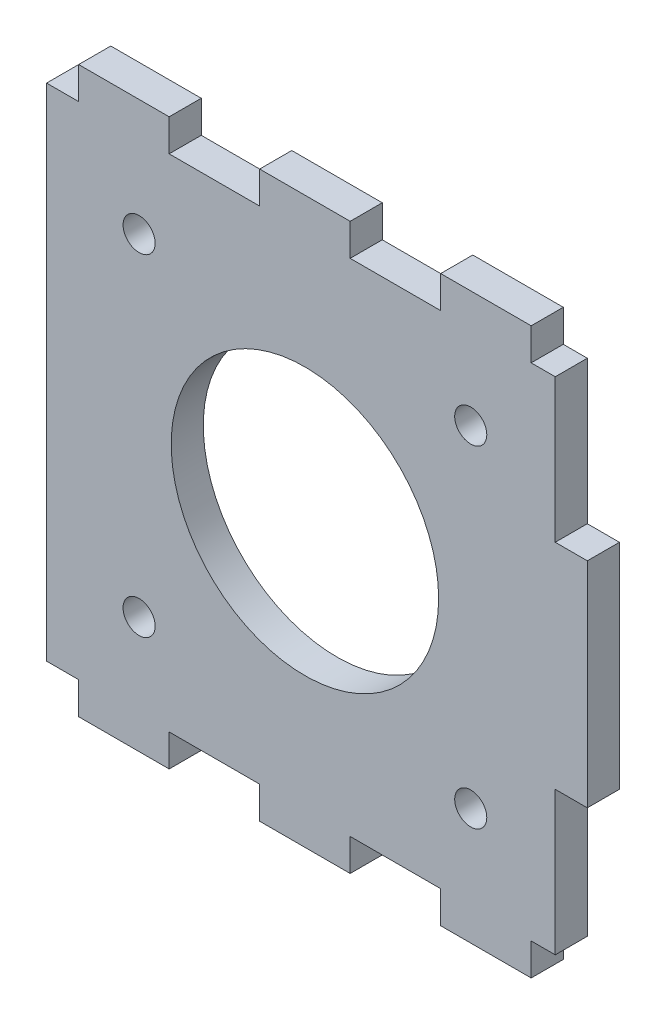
from build123d import *

# Parameters (mm, degrees)
SKETCH1_R           = 1.5
SKETCH1_R_2         = 12.5
SKETCH1_W           = 8.46
SKETCH1_H           = 3
SKETCH1_W_2         = 3
SKETCH1_H_2         = 20
BOSS_EXTRUDE1_DEPTH = 3


with BuildPart() as part:
    # Sketch1 → Boss-Extrude1 (new body)
    # profile 1 of 8: a face of its own
    with BuildSketch(Plane.XY):
        Polygon((3.105, -23.4), (11.565, -23.4), (20.025, -23.4), (22.275, -23.4), (22.275, -10), (22.275, 10), (22.275, 23.4), (20.025, 23.4), (11.565, 23.4), (3.105, 23.4), (-5.355, 23.4), (-13.815, 23.4), (-22.275, 23.4), (-25.275, 23.4), (-25.275, -23.4), (-22.275, -23.4), (-13.815, -23.4), (-5.355, -23.4), align=None)
        with Locations((-16.625, -15.5)):
            Circle(SKETCH1_R, mode=Mode.SUBTRACT)
        with Locations((-1.125, 0)):
            Circle(SKETCH1_R_2, mode=Mode.SUBTRACT)
        with Locations((14.375, -15.5)):
            Circle(SKETCH1_R, mode=Mode.SUBTRACT)
        with Locations((-16.625, 15.5)):
            Circle(SKETCH1_R, mode=Mode.SUBTRACT)
        with Locations((14.375, 15.5)):
            Circle(SKETCH1_R, mode=Mode.SUBTRACT)
    # profile 2 of 8: a face of its own
    with BuildSketch(Plane.XY):
        with Locations((15.795, 24.9)):
            Rectangle(SKETCH1_W, SKETCH1_H)
    # profile 3 of 8: a face of its own
    with BuildSketch(Plane.XY):
        with Locations((-1.125, 24.9)):
            Rectangle(SKETCH1_W, SKETCH1_H)
    # profile 4 of 8: a face of its own
    with BuildSketch(Plane.XY):
        with Locations((-18.045, 24.9)):
            Rectangle(SKETCH1_W, SKETCH1_H)
    # profile 5 of 8: a face of its own
    with BuildSketch(Plane.XY):
        with Locations((23.775, 0)):
            Rectangle(SKETCH1_W_2, SKETCH1_H_2)
    # profile 6 of 8: a face of its own
    with BuildSketch(Plane.XY):
        with Locations((15.795, -24.9)):
            Rectangle(SKETCH1_W, SKETCH1_H)
    # profile 7 of 8: a face of its own
    with BuildSketch(Plane.XY):
        with Locations((-1.125, -24.9)):
            Rectangle(SKETCH1_W, SKETCH1_H)
    # profile 8 of 8: a face of its own
    with BuildSketch(Plane.XY):
        with Locations((-18.045, -24.9)):
            Rectangle(SKETCH1_W, SKETCH1_H)
    extrude(amount=BOSS_EXTRUDE1_DEPTH)


solid = part.part
